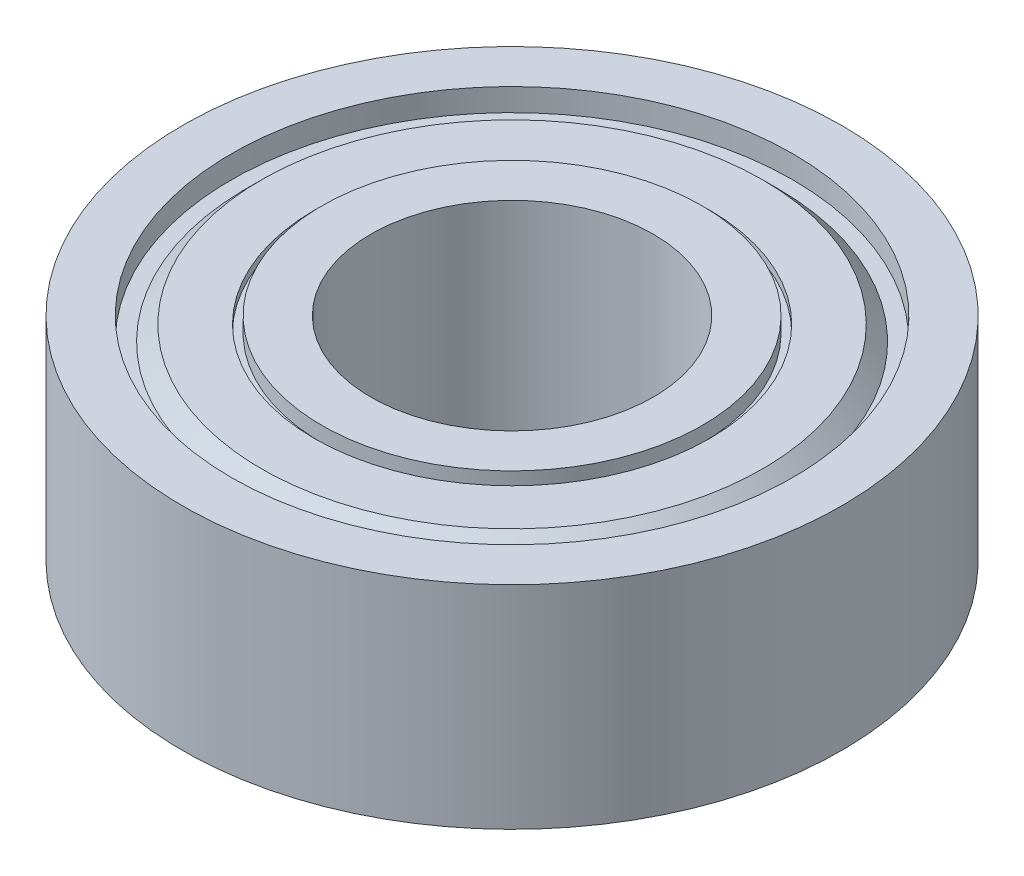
from build123d import *


with BuildPart() as part:
    # Sketch1 → Base-Revolve (revolve)
    with BuildSketch(Plane.XY, mode=Mode.PRIVATE) as base_revolve_sk:
        Polygon((4.7625, 0), (4.7625, 7.14375), (6.4135, 7.14375), (6.4135, 6.63575), (6.6675, 6.63575), (6.6675, 6.88975), (8.4455, 6.88975), (8.9535, 6.38175), (9.4615, 6.38175), (9.4615, 7.14375), (11.1125, 7.14375), (11.1125, 0), (9.4615, 0), (9.4615, 0.762), (8.9535, 0.762), (8.4455, 0.254), (6.6675, 0.254), (6.6675, 0.508), (6.4135, 0.508), (6.4135, 0), align=None)
    revolve(base_revolve_sk.sketch.rotate(Axis((0, 0, 0), (0, 1, 0)), 90), axis=Axis((0, 0, 0), (0, 1, 0)))


solid = part.part
